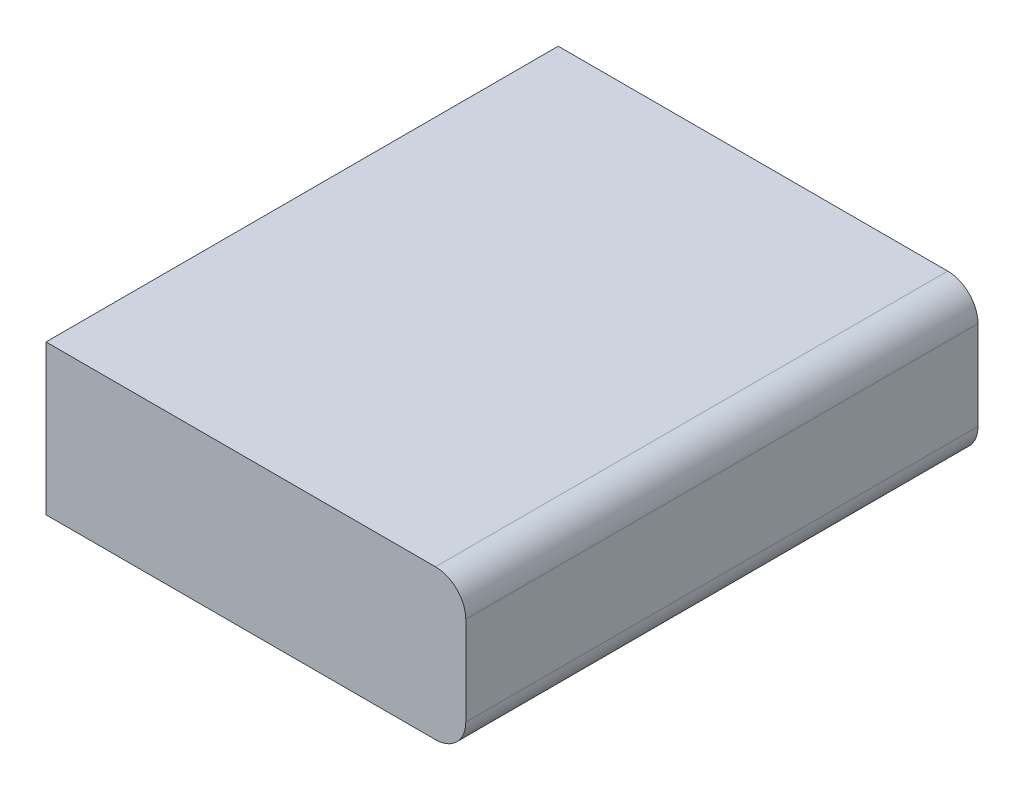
from build123d import *

# Parameters (mm, degrees)
SKETCH1_W           = 138.5
SKETCH1_H           = 49.4
BOSS_EXTRUDE1_DEPTH = 169
FILLET1_R           = 10
SKETCH2_W           = 56
SKETCH2_H           = 20
CUT_EXTRUDE2_DEPTH  = 1
SKETCH3_R           = 3.5
CUT_EXTRUDE1_DEPTH  = 10


with BuildPart() as part:
    # Sketch1 → Boss-Extrude1 (new body)
    with BuildSketch(Plane.XY):
        with Locations((-39.444413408, 0.344972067)):
            Rectangle(SKETCH1_W, SKETCH1_H)
    extrude(amount=BOSS_EXTRUDE1_DEPTH)

    # Fillet1
    fillet1_edges = [part.edges().sort_by_distance(p)[0] for p in [
        (29.805586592, 25.044972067, 84.5),
        (29.805586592, -24.355027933, 84.5),
    ]]
    fillet(fillet1_edges, radius=FILLET1_R)

    # Sketch2 → Cut-Extrude2 (cut)
    with BuildSketch(Plane.ZY.offset(108.694413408)):
        with Locations((58, 8.044972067)):
            Rectangle(SKETCH2_W, SKETCH2_H)
    extrude(amount=-CUT_EXTRUDE2_DEPTH, mode=Mode.SUBTRACT)

    # Sketch3 → Cut-Extrude1 (cut)
    with BuildSketch(Plane.ZY.offset(108.694413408)):
        with Locations(Location((35, 13.044972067, 0), (0, 0, 270))):
            Circle(SKETCH3_R)
    extrude(amount=-CUT_EXTRUDE1_DEPTH, mode=Mode.SUBTRACT)


solid = part.part
